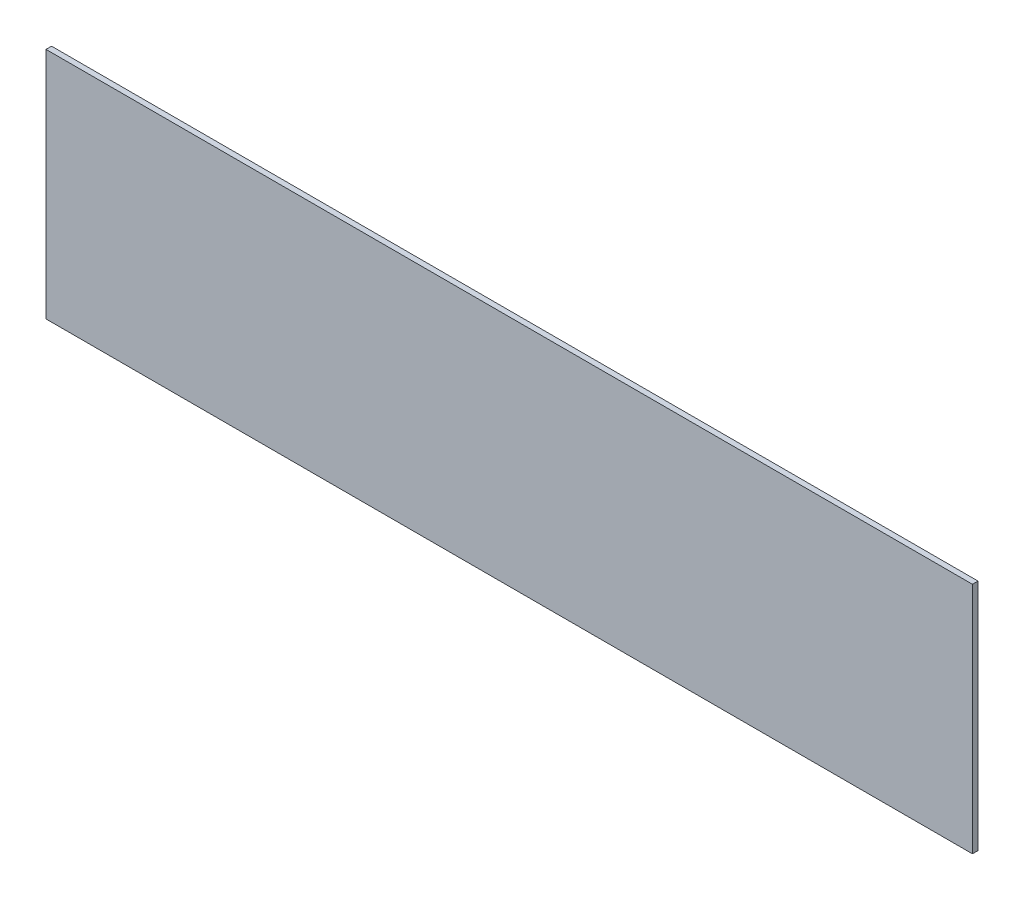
ISO-10303-21;
HEADER;
FILE_DESCRIPTION(('STEP AP214'),'2;1');
FILE_NAME('part.step','',(''),(''),'','','');
FILE_SCHEMA(('AUTOMOTIVE_DESIGN { 1 0 10303 214 1 1 1 1 }'));
ENDSEC;
DATA;
#1=APPLICATION_CONTEXT('core data for automotive mechanical design processes');
#2=APPLICATION_PROTOCOL_DEFINITION('international standard','automotive_design',2000,#1);
#3=PRODUCT_CONTEXT('',#1,'mechanical');
#4=PRODUCT('Part','Part','',(#3));
#5=PRODUCT_RELATED_PRODUCT_CATEGORY('part','',(#4));
#6=PRODUCT_DEFINITION_FORMATION('','',#4);
#7=PRODUCT_DEFINITION_CONTEXT('part definition',#1,'design');
#8=PRODUCT_DEFINITION('design','',#6,#7);
#9=PRODUCT_DEFINITION_SHAPE('','',#8);
#10=(LENGTH_UNIT() NAMED_UNIT(*) SI_UNIT(.MILLI.,.METRE.));
#11=(NAMED_UNIT(*) PLANE_ANGLE_UNIT() SI_UNIT($,.RADIAN.));
#12=(NAMED_UNIT(*) SI_UNIT($,.STERADIAN.) SOLID_ANGLE_UNIT());
#13=UNCERTAINTY_MEASURE_WITH_UNIT(LENGTH_MEASURE(1.E-05),#10,'distance_accuracy_value','');
#14=(GEOMETRIC_REPRESENTATION_CONTEXT(3) GLOBAL_UNCERTAINTY_ASSIGNED_CONTEXT((#13)) GLOBAL_UNIT_ASSIGNED_CONTEXT((#10,
#11,#12)) REPRESENTATION_CONTEXT('',''));
#15=CARTESIAN_POINT('',(0.,0.,0.));
#16=DIRECTION('',(0.,0.,1.));
#17=DIRECTION('',(1.,0.,0.));
#18=AXIS2_PLACEMENT_3D('',#15,#16,#17);
#19=CARTESIAN_POINT('',(0.,0.,0.));
#20=DIRECTION('',(0.,0.,1.));
#21=DIRECTION('',(1.,0.,0.));
#22=AXIS2_PLACEMENT_3D('',#19,#20,#21);
#23=PLANE('',#22);
#24=DIRECTION('',(0.,1.,0.));
#25=VECTOR('',#24,1.);
#26=CARTESIAN_POINT('',(250.,63.,0.));
#27=LINE('',#26,#25);
#28=CARTESIAN_POINT('',(250.,-63.,0.));
#29=VERTEX_POINT('',#28);
#30=CARTESIAN_POINT('',(250.,63.,0.));
#31=VERTEX_POINT('',#30);
#32=EDGE_CURVE('E93',#29,#31,#27,.T.);
#33=ORIENTED_EDGE('',*,*,#32,.F.);
#34=DIRECTION('',(1.,0.,0.));
#35=VECTOR('',#34,1.);
#36=CARTESIAN_POINT('',(-250.,-63.,0.));
#37=LINE('',#36,#35);
#38=CARTESIAN_POINT('',(-250.,-63.,0.));
#39=VERTEX_POINT('',#38);
#40=EDGE_CURVE('E26',#39,#29,#37,.T.);
#41=ORIENTED_EDGE('',*,*,#40,.F.);
#42=DIRECTION('',(0.,-1.,0.));
#43=VECTOR('',#42,1.);
#44=CARTESIAN_POINT('',(-250.,63.,0.));
#45=LINE('',#44,#43);
#46=CARTESIAN_POINT('',(-250.,63.,0.));
#47=VERTEX_POINT('',#46);
#48=EDGE_CURVE('E84',#47,#39,#45,.T.);
#49=ORIENTED_EDGE('',*,*,#48,.F.);
#50=DIRECTION('',(-1.,0.,0.));
#51=VECTOR('',#50,1.);
#52=CARTESIAN_POINT('',(-250.,63.,0.));
#53=LINE('',#52,#51);
#54=EDGE_CURVE('E19',#31,#47,#53,.T.);
#55=ORIENTED_EDGE('',*,*,#54,.F.);
#56=EDGE_LOOP('',(#33,#41,#49,#55));
#57=FACE_BOUND('',#56,.T.);
#58=ADVANCED_FACE('F15',(#57),#23,.F.);
#59=CARTESIAN_POINT('',(0.,0.,3.));
#60=DIRECTION('',(0.,0.,1.));
#61=DIRECTION('',(1.,0.,0.));
#62=AXIS2_PLACEMENT_3D('',#59,#60,#61);
#63=PLANE('',#62);
#64=DIRECTION('',(0.,1.,0.));
#65=VECTOR('',#64,1.);
#66=CARTESIAN_POINT('',(250.,63.,3.));
#67=LINE('',#66,#65);
#68=CARTESIAN_POINT('',(250.,-63.,3.));
#69=VERTEX_POINT('',#68);
#70=CARTESIAN_POINT('',(250.,63.,3.));
#71=VERTEX_POINT('',#70);
#72=EDGE_CURVE('E79',#69,#71,#67,.T.);
#73=ORIENTED_EDGE('',*,*,#72,.T.);
#74=DIRECTION('',(-1.,0.,0.));
#75=VECTOR('',#74,1.);
#76=CARTESIAN_POINT('',(-250.,63.,3.));
#77=LINE('',#76,#75);
#78=CARTESIAN_POINT('',(-250.,63.,3.));
#79=VERTEX_POINT('',#78);
#80=EDGE_CURVE('E76',#71,#79,#77,.T.);
#81=ORIENTED_EDGE('',*,*,#80,.T.);
#82=DIRECTION('',(0.,-1.,0.));
#83=VECTOR('',#82,1.);
#84=CARTESIAN_POINT('',(-250.,63.,3.));
#85=LINE('',#84,#83);
#86=CARTESIAN_POINT('',(-250.,-63.,3.));
#87=VERTEX_POINT('',#86);
#88=EDGE_CURVE('E64',#79,#87,#85,.T.);
#89=ORIENTED_EDGE('',*,*,#88,.T.);
#90=DIRECTION('',(1.,0.,0.));
#91=VECTOR('',#90,1.);
#92=CARTESIAN_POINT('',(-250.,-63.,3.));
#93=LINE('',#92,#91);
#94=EDGE_CURVE('E9',#87,#69,#93,.T.);
#95=ORIENTED_EDGE('',*,*,#94,.T.);
#96=EDGE_LOOP('',(#73,#81,#89,#95));
#97=FACE_BOUND('',#96,.T.);
#98=ADVANCED_FACE('F77',(#97),#63,.T.);
#99=CARTESIAN_POINT('',(-250.,-63.,3.));
#100=DIRECTION('',(0.,1.,0.));
#101=DIRECTION('',(1.,0.,0.));
#102=AXIS2_PLACEMENT_3D('',#99,#100,#101);
#103=PLANE('',#102);
#104=ORIENTED_EDGE('',*,*,#40,.T.);
#105=DIRECTION('',(0.,0.,-1.));
#106=VECTOR('',#105,1.);
#107=CARTESIAN_POINT('',(250.,-63.,3.));
#108=LINE('',#107,#106);
#109=EDGE_CURVE('E91',#69,#29,#108,.T.);
#110=ORIENTED_EDGE('',*,*,#109,.F.);
#111=ORIENTED_EDGE('',*,*,#94,.F.);
#112=DIRECTION('',(0.,0.,-1.));
#113=VECTOR('',#112,1.);
#114=CARTESIAN_POINT('',(-250.,-63.,3.));
#115=LINE('',#114,#113);
#116=EDGE_CURVE('E70',#87,#39,#115,.T.);
#117=ORIENTED_EDGE('',*,*,#116,.T.);
#118=EDGE_LOOP('',(#104,#110,#111,#117));
#119=FACE_BOUND('',#118,.T.);
#120=ADVANCED_FACE('F144',(#119),#103,.F.);
#121=CARTESIAN_POINT('',(-250.,63.,3.));
#122=DIRECTION('',(1.,0.,0.));
#123=DIRECTION('',(0.,-1.,0.));
#124=AXIS2_PLACEMENT_3D('',#121,#122,#123);
#125=PLANE('',#124);
#126=ORIENTED_EDGE('',*,*,#48,.T.);
#127=ORIENTED_EDGE('',*,*,#116,.F.);
#128=ORIENTED_EDGE('',*,*,#88,.F.);
#129=DIRECTION('',(0.,0.,-1.));
#130=VECTOR('',#129,1.);
#131=CARTESIAN_POINT('',(-250.,63.,3.));
#132=LINE('',#131,#130);
#133=EDGE_CURVE('E68',#79,#47,#132,.T.);
#134=ORIENTED_EDGE('',*,*,#133,.T.);
#135=EDGE_LOOP('',(#126,#127,#128,#134));
#136=FACE_BOUND('',#135,.T.);
#137=ADVANCED_FACE('F17',(#136),#125,.F.);
#138=CARTESIAN_POINT('',(-250.,63.,3.));
#139=DIRECTION('',(0.,-1.,0.));
#140=DIRECTION('',(0.,0.,-1.));
#141=AXIS2_PLACEMENT_3D('',#138,#139,#140);
#142=PLANE('',#141);
#143=ORIENTED_EDGE('',*,*,#54,.T.);
#144=ORIENTED_EDGE('',*,*,#133,.F.);
#145=ORIENTED_EDGE('',*,*,#80,.F.);
#146=DIRECTION('',(0.,0.,-1.));
#147=VECTOR('',#146,1.);
#148=CARTESIAN_POINT('',(250.,63.,3.));
#149=LINE('',#148,#147);
#150=EDGE_CURVE('E97',#71,#31,#149,.T.);
#151=ORIENTED_EDGE('',*,*,#150,.T.);
#152=EDGE_LOOP('',(#143,#144,#145,#151));
#153=FACE_BOUND('',#152,.T.);
#154=ADVANCED_FACE('F85',(#153),#142,.F.);
#155=CARTESIAN_POINT('',(250.,63.,3.));
#156=DIRECTION('',(-1.,0.,0.));
#157=DIRECTION('',(0.,1.,0.));
#158=AXIS2_PLACEMENT_3D('',#155,#156,#157);
#159=PLANE('',#158);
#160=ORIENTED_EDGE('',*,*,#32,.T.);
#161=ORIENTED_EDGE('',*,*,#150,.F.);
#162=ORIENTED_EDGE('',*,*,#72,.F.);
#163=ORIENTED_EDGE('',*,*,#109,.T.);
#164=EDGE_LOOP('',(#160,#161,#162,#163));
#165=FACE_BOUND('',#164,.T.);
#166=ADVANCED_FACE('F130',(#165),#159,.F.);
#167=CLOSED_SHELL('',(#58,#98,#120,#137,#154,#166));
#168=MANIFOLD_SOLID_BREP('B1',#167);
#169=ADVANCED_BREP_SHAPE_REPRESENTATION('',(#18,#168),#14);
#170=SHAPE_DEFINITION_REPRESENTATION(#9,#169);
ENDSEC;
END-ISO-10303-21;
